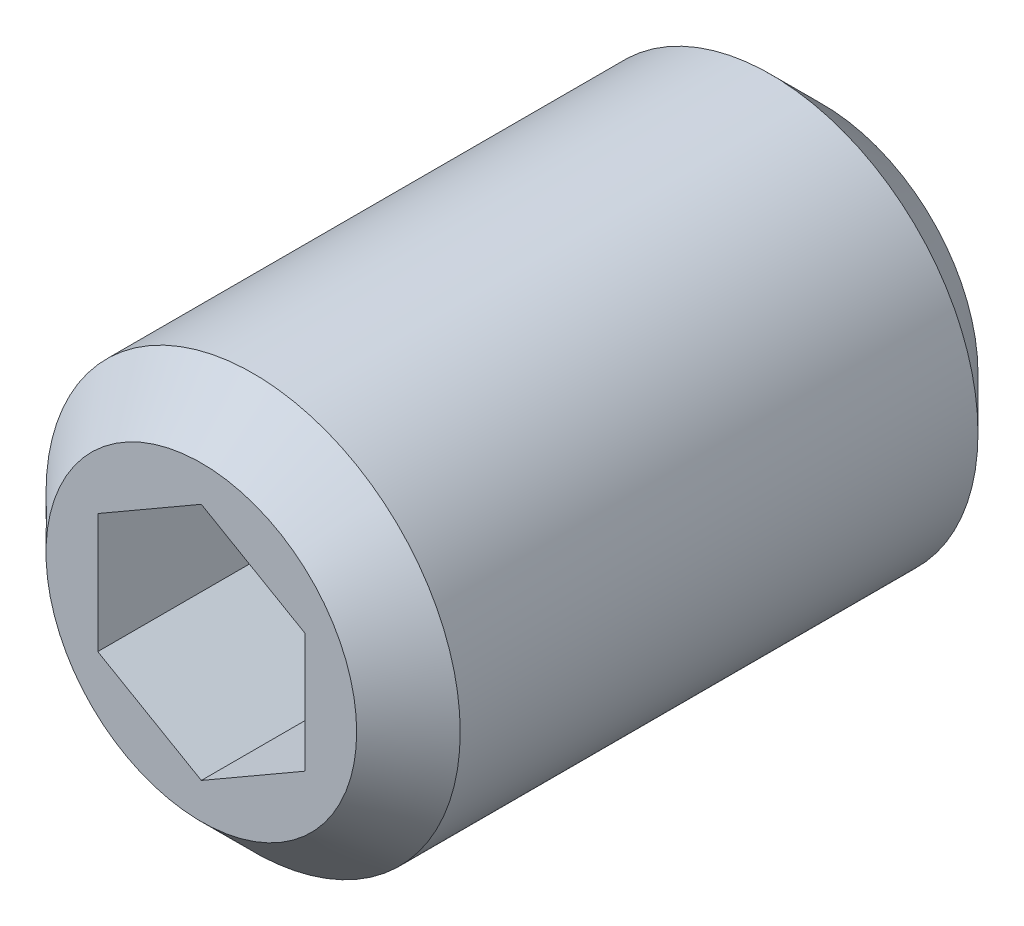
ISO-10303-21;
HEADER;
FILE_DESCRIPTION(('STEP AP214'),'2;1');
FILE_NAME('part.step','',(''),(''),'','','');
FILE_SCHEMA(('AUTOMOTIVE_DESIGN { 1 0 10303 214 1 1 1 1 }'));
ENDSEC;
DATA;
#1=APPLICATION_CONTEXT('core data for automotive mechanical design processes');
#2=APPLICATION_PROTOCOL_DEFINITION('international standard','automotive_design',2000,#1);
#3=PRODUCT_CONTEXT('',#1,'mechanical');
#4=PRODUCT('Part','Part','',(#3));
#5=PRODUCT_RELATED_PRODUCT_CATEGORY('part','',(#4));
#6=PRODUCT_DEFINITION_FORMATION('','',#4);
#7=PRODUCT_DEFINITION_CONTEXT('part definition',#1,'design');
#8=PRODUCT_DEFINITION('design','',#6,#7);
#9=PRODUCT_DEFINITION_SHAPE('','',#8);
#10=(LENGTH_UNIT() NAMED_UNIT(*) SI_UNIT(.MILLI.,.METRE.));
#11=(NAMED_UNIT(*) PLANE_ANGLE_UNIT() SI_UNIT($,.RADIAN.));
#12=(NAMED_UNIT(*) SI_UNIT($,.STERADIAN.) SOLID_ANGLE_UNIT());
#13=UNCERTAINTY_MEASURE_WITH_UNIT(LENGTH_MEASURE(1.E-05),#10,'distance_accuracy_value','');
#14=(GEOMETRIC_REPRESENTATION_CONTEXT(3) GLOBAL_UNCERTAINTY_ASSIGNED_CONTEXT((#13)) GLOBAL_UNIT_ASSIGNED_CONTEXT((#10,
#11,#12)) REPRESENTATION_CONTEXT('',''));
#15=CARTESIAN_POINT('',(0.,0.,0.));
#16=DIRECTION('',(0.,0.,1.));
#17=DIRECTION('',(1.,0.,0.));
#18=AXIS2_PLACEMENT_3D('',#15,#16,#17);
#19=CARTESIAN_POINT('',(0.,0.,0.));
#20=DIRECTION('',(0.,0.,1.));
#21=DIRECTION('',(1.,0.,0.));
#22=AXIS2_PLACEMENT_3D('',#19,#20,#21);
#23=CYLINDRICAL_SURFACE('',#22,2.);
#24=CARTESIAN_POINT('',(0.,0.,0.5));
#25=DIRECTION('',(0.,0.,1.));
#26=DIRECTION('',(1.,0.,0.));
#27=AXIS2_PLACEMENT_3D('',#24,#25,#26);
#28=CIRCLE('',#27,2.);
#29=CARTESIAN_POINT('',(2.,0.,0.5));
#30=VERTEX_POINT('',#29);
#31=EDGE_CURVE('E21',#30,#30,#28,.T.);
#32=ORIENTED_EDGE('',*,*,#31,.T.);
#33=EDGE_LOOP('',(#32));
#34=FACE_BOUND('',#33,.T.);
#35=CARTESIAN_POINT('',(0.,0.,5.5));
#36=DIRECTION('',(0.,0.,1.));
#37=DIRECTION('',(1.,0.,0.));
#38=AXIS2_PLACEMENT_3D('',#35,#36,#37);
#39=CIRCLE('',#38,2.);
#40=CARTESIAN_POINT('',(2.,0.,5.5));
#41=VERTEX_POINT('',#40);
#42=EDGE_CURVE('E124',#41,#41,#39,.F.);
#43=ORIENTED_EDGE('',*,*,#42,.T.);
#44=EDGE_LOOP('',(#43));
#45=FACE_BOUND('',#44,.T.);
#46=ADVANCED_FACE('F14',(#34,#45),#23,.T.);
#47=CARTESIAN_POINT('',(0.,0.,0.));
#48=DIRECTION('',(0.,0.,1.));
#49=DIRECTION('',(1.,0.,0.));
#50=AXIS2_PLACEMENT_3D('',#47,#48,#49);
#51=PLANE('',#50);
#52=CARTESIAN_POINT('',(0.,0.,0.));
#53=DIRECTION('',(0.,0.,1.));
#54=DIRECTION('',(1.,0.,0.));
#55=AXIS2_PLACEMENT_3D('',#52,#53,#54);
#56=CIRCLE('',#55,1.5);
#57=CARTESIAN_POINT('',(1.5,0.,0.));
#58=VERTEX_POINT('',#57);
#59=EDGE_CURVE('E9',#58,#58,#56,.F.);
#60=ORIENTED_EDGE('',*,*,#59,.T.);
#61=EDGE_LOOP('',(#60));
#62=FACE_BOUND('',#61,.T.);
#63=ADVANCED_FACE('F146',(#62),#51,.F.);
#64=CARTESIAN_POINT('',(0.,0.,6.));
#65=DIRECTION('',(0.,0.,1.));
#66=DIRECTION('',(1.,0.,0.));
#67=AXIS2_PLACEMENT_3D('',#64,#65,#66);
#68=PLANE('',#67);
#69=CARTESIAN_POINT('',(0.,0.,6.));
#70=DIRECTION('',(0.,0.,1.));
#71=DIRECTION('',(1.,0.,0.));
#72=AXIS2_PLACEMENT_3D('',#69,#70,#71);
#73=CIRCLE('',#72,1.5);
#74=CARTESIAN_POINT('',(1.5,0.,6.));
#75=VERTEX_POINT('',#74);
#76=EDGE_CURVE('E115',#75,#75,#73,.T.);
#77=ORIENTED_EDGE('',*,*,#76,.T.);
#78=EDGE_LOOP('',(#77));
#79=FACE_BOUND('',#78,.T.);
#80=DIRECTION('',(-0.866025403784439,0.5,0.));
#81=VECTOR('',#80,1.);
#82=CARTESIAN_POINT('',(1.,0.577350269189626,6.));
#83=LINE('',#82,#81);
#84=CARTESIAN_POINT('',(1.,0.577350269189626,6.));
#85=VERTEX_POINT('',#84);
#86=CARTESIAN_POINT('',(0.,1.15470053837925,6.));
#87=VERTEX_POINT('',#86);
#88=EDGE_CURVE('E28',#85,#87,#83,.T.);
#89=ORIENTED_EDGE('',*,*,#88,.F.);
#90=DIRECTION('',(0.,1.,0.));
#91=VECTOR('',#90,1.);
#92=CARTESIAN_POINT('',(1.,-0.577350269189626,6.));
#93=LINE('',#92,#91);
#94=CARTESIAN_POINT('',(1.,-0.577350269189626,6.));
#95=VERTEX_POINT('',#94);
#96=EDGE_CURVE('E97',#95,#85,#93,.T.);
#97=ORIENTED_EDGE('',*,*,#96,.F.);
#98=DIRECTION('',(0.866025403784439,0.5,0.));
#99=VECTOR('',#98,1.);
#100=CARTESIAN_POINT('',(0.,-1.15470053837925,6.));
#101=LINE('',#100,#99);
#102=CARTESIAN_POINT('',(0.,-1.15470053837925,6.));
#103=VERTEX_POINT('',#102);
#104=EDGE_CURVE('E91',#103,#95,#101,.T.);
#105=ORIENTED_EDGE('',*,*,#104,.F.);
#106=DIRECTION('',(0.866025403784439,-0.5,0.));
#107=VECTOR('',#106,1.);
#108=CARTESIAN_POINT('',(-1.,-0.577350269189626,6.));
#109=LINE('',#108,#107);
#110=CARTESIAN_POINT('',(-1.,-0.577350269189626,6.));
#111=VERTEX_POINT('',#110);
#112=EDGE_CURVE('E89',#111,#103,#109,.T.);
#113=ORIENTED_EDGE('',*,*,#112,.F.);
#114=DIRECTION('',(0.,-1.,0.));
#115=VECTOR('',#114,1.);
#116=CARTESIAN_POINT('',(-1.,0.577350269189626,6.));
#117=LINE('',#116,#115);
#118=CARTESIAN_POINT('',(-1.,0.577350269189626,6.));
#119=VERTEX_POINT('',#118);
#120=EDGE_CURVE('E71',#119,#111,#117,.T.);
#121=ORIENTED_EDGE('',*,*,#120,.F.);
#122=DIRECTION('',(-0.866025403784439,-0.5,0.));
#123=VECTOR('',#122,1.);
#124=CARTESIAN_POINT('',(0.,1.15470053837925,6.));
#125=LINE('',#124,#123);
#126=EDGE_CURVE('E82',#87,#119,#125,.T.);
#127=ORIENTED_EDGE('',*,*,#126,.F.);
#128=EDGE_LOOP('',(#89,#97,#105,#113,#121,#127));
#129=FACE_BOUND('',#128,.T.);
#130=ADVANCED_FACE('F86',(#79,#129),#68,.T.);
#131=CARTESIAN_POINT('',(1.,0.577350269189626,4.));
#132=DIRECTION('',(0.5,0.866025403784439,0.));
#133=DIRECTION('',(-0.866025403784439,0.5,0.));
#134=AXIS2_PLACEMENT_3D('',#131,#132,#133);
#135=PLANE('',#134);
#136=ORIENTED_EDGE('',*,*,#88,.T.);
#137=DIRECTION('',(0.,0.,1.));
#138=VECTOR('',#137,1.);
#139=CARTESIAN_POINT('',(0.,1.15470053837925,4.));
#140=LINE('',#139,#138);
#141=CARTESIAN_POINT('',(0.,1.15470053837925,4.));
#142=VERTEX_POINT('',#141);
#143=EDGE_CURVE('E79',#142,#87,#140,.T.);
#144=ORIENTED_EDGE('',*,*,#143,.F.);
#145=DIRECTION('',(-0.866025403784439,0.5,0.));
#146=VECTOR('',#145,1.);
#147=CARTESIAN_POINT('',(1.,0.577350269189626,4.));
#148=LINE('',#147,#146);
#149=CARTESIAN_POINT('',(1.,0.577350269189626,4.));
#150=VERTEX_POINT('',#149);
#151=EDGE_CURVE('E99',#150,#142,#148,.T.);
#152=ORIENTED_EDGE('',*,*,#151,.F.);
#153=DIRECTION('',(0.,0.,1.));
#154=VECTOR('',#153,1.);
#155=CARTESIAN_POINT('',(1.,0.577350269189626,4.));
#156=LINE('',#155,#154);
#157=EDGE_CURVE('E35',#150,#85,#156,.T.);
#158=ORIENTED_EDGE('',*,*,#157,.T.);
#159=EDGE_LOOP('',(#136,#144,#152,#158));
#160=FACE_BOUND('',#159,.T.);
#161=ADVANCED_FACE('F156',(#160),#135,.F.);
#162=CARTESIAN_POINT('',(1.,-0.577350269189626,4.));
#163=DIRECTION('',(1.,0.,0.));
#164=DIRECTION('',(0.,1.,0.));
#165=AXIS2_PLACEMENT_3D('',#162,#163,#164);
#166=PLANE('',#165);
#167=ORIENTED_EDGE('',*,*,#96,.T.);
#168=ORIENTED_EDGE('',*,*,#157,.F.);
#169=DIRECTION('',(0.,1.,0.));
#170=VECTOR('',#169,1.);
#171=CARTESIAN_POINT('',(1.,-0.577350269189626,4.));
#172=LINE('',#171,#170);
#173=CARTESIAN_POINT('',(1.,-0.577350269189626,4.));
#174=VERTEX_POINT('',#173);
#175=EDGE_CURVE('E111',#174,#150,#172,.T.);
#176=ORIENTED_EDGE('',*,*,#175,.F.);
#177=DIRECTION('',(0.,0.,1.));
#178=VECTOR('',#177,1.);
#179=CARTESIAN_POINT('',(1.,-0.577350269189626,4.));
#180=LINE('',#179,#178);
#181=EDGE_CURVE('E116',#174,#95,#180,.T.);
#182=ORIENTED_EDGE('',*,*,#181,.T.);
#183=EDGE_LOOP('',(#167,#168,#176,#182));
#184=FACE_BOUND('',#183,.T.);
#185=ADVANCED_FACE('F162',(#184),#166,.F.);
#186=CARTESIAN_POINT('',(0.,-1.15470053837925,4.));
#187=DIRECTION('',(0.5,-0.866025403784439,0.));
#188=DIRECTION('',(0.866025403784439,0.5,0.));
#189=AXIS2_PLACEMENT_3D('',#186,#187,#188);
#190=PLANE('',#189);
#191=ORIENTED_EDGE('',*,*,#104,.T.);
#192=ORIENTED_EDGE('',*,*,#181,.F.);
#193=DIRECTION('',(0.866025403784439,0.5,0.));
#194=VECTOR('',#193,1.);
#195=CARTESIAN_POINT('',(0.,-1.15470053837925,4.));
#196=LINE('',#195,#194);
#197=CARTESIAN_POINT('',(0.,-1.15470053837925,4.));
#198=VERTEX_POINT('',#197);
#199=EDGE_CURVE('E108',#198,#174,#196,.T.);
#200=ORIENTED_EDGE('',*,*,#199,.F.);
#201=DIRECTION('',(0.,0.,1.));
#202=VECTOR('',#201,1.);
#203=CARTESIAN_POINT('',(0.,-1.15470053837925,4.));
#204=LINE('',#203,#202);
#205=EDGE_CURVE('E118',#198,#103,#204,.T.);
#206=ORIENTED_EDGE('',*,*,#205,.T.);
#207=EDGE_LOOP('',(#191,#192,#200,#206));
#208=FACE_BOUND('',#207,.T.);
#209=ADVANCED_FACE('F170',(#208),#190,.F.);
#210=CARTESIAN_POINT('',(-1.,-0.577350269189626,4.));
#211=DIRECTION('',(-0.5,-0.866025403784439,0.));
#212=DIRECTION('',(0.866025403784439,-0.5,0.));
#213=AXIS2_PLACEMENT_3D('',#210,#211,#212);
#214=PLANE('',#213);
#215=ORIENTED_EDGE('',*,*,#112,.T.);
#216=ORIENTED_EDGE('',*,*,#205,.F.);
#217=DIRECTION('',(0.866025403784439,-0.5,0.));
#218=VECTOR('',#217,1.);
#219=CARTESIAN_POINT('',(-1.,-0.577350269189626,4.));
#220=LINE('',#219,#218);
#221=CARTESIAN_POINT('',(-1.,-0.577350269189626,4.));
#222=VERTEX_POINT('',#221);
#223=EDGE_CURVE('E105',#222,#198,#220,.T.);
#224=ORIENTED_EDGE('',*,*,#223,.F.);
#225=DIRECTION('',(0.,0.,1.));
#226=VECTOR('',#225,1.);
#227=CARTESIAN_POINT('',(-1.,-0.577350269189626,4.));
#228=LINE('',#227,#226);
#229=EDGE_CURVE('E78',#222,#111,#228,.T.);
#230=ORIENTED_EDGE('',*,*,#229,.T.);
#231=EDGE_LOOP('',(#215,#216,#224,#230));
#232=FACE_BOUND('',#231,.T.);
#233=ADVANCED_FACE('F167',(#232),#214,.F.);
#234=CARTESIAN_POINT('',(-1.,0.577350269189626,4.));
#235=DIRECTION('',(-1.,0.,0.));
#236=DIRECTION('',(0.,0.,1.));
#237=AXIS2_PLACEMENT_3D('',#234,#235,#236);
#238=PLANE('',#237);
#239=ORIENTED_EDGE('',*,*,#120,.T.);
#240=ORIENTED_EDGE('',*,*,#229,.F.);
#241=DIRECTION('',(0.,-1.,0.));
#242=VECTOR('',#241,1.);
#243=CARTESIAN_POINT('',(-1.,0.577350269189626,4.));
#244=LINE('',#243,#242);
#245=CARTESIAN_POINT('',(-1.,0.577350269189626,4.));
#246=VERTEX_POINT('',#245);
#247=EDGE_CURVE('E74',#246,#222,#244,.T.);
#248=ORIENTED_EDGE('',*,*,#247,.F.);
#249=DIRECTION('',(0.,0.,1.));
#250=VECTOR('',#249,1.);
#251=CARTESIAN_POINT('',(-1.,0.577350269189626,4.));
#252=LINE('',#251,#250);
#253=EDGE_CURVE('E67',#246,#119,#252,.T.);
#254=ORIENTED_EDGE('',*,*,#253,.T.);
#255=EDGE_LOOP('',(#239,#240,#248,#254));
#256=FACE_BOUND('',#255,.T.);
#257=ADVANCED_FACE('F69',(#256),#238,.F.);
#258=CARTESIAN_POINT('',(0.,1.15470053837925,4.));
#259=DIRECTION('',(-0.5,0.866025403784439,0.));
#260=DIRECTION('',(-0.866025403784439,-0.5,0.));
#261=AXIS2_PLACEMENT_3D('',#258,#259,#260);
#262=PLANE('',#261);
#263=ORIENTED_EDGE('',*,*,#126,.T.);
#264=ORIENTED_EDGE('',*,*,#253,.F.);
#265=DIRECTION('',(-0.866025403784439,-0.5,0.));
#266=VECTOR('',#265,1.);
#267=CARTESIAN_POINT('',(0.,1.15470053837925,4.));
#268=LINE('',#267,#266);
#269=EDGE_CURVE('E102',#142,#246,#268,.T.);
#270=ORIENTED_EDGE('',*,*,#269,.F.);
#271=ORIENTED_EDGE('',*,*,#143,.T.);
#272=EDGE_LOOP('',(#263,#264,#270,#271));
#273=FACE_BOUND('',#272,.T.);
#274=ADVANCED_FACE('F83',(#273),#262,.F.);
#275=CARTESIAN_POINT('',(0.,1.15470053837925,4.));
#276=DIRECTION('',(0.,0.,1.));
#277=DIRECTION('',(1.,0.,0.));
#278=AXIS2_PLACEMENT_3D('',#275,#276,#277);
#279=PLANE('',#278);
#280=ORIENTED_EDGE('',*,*,#151,.T.);
#281=ORIENTED_EDGE('',*,*,#269,.T.);
#282=ORIENTED_EDGE('',*,*,#247,.T.);
#283=ORIENTED_EDGE('',*,*,#223,.T.);
#284=ORIENTED_EDGE('',*,*,#199,.T.);
#285=ORIENTED_EDGE('',*,*,#175,.T.);
#286=EDGE_LOOP('',(#280,#281,#282,#283,#284,#285));
#287=FACE_BOUND('',#286,.T.);
#288=ADVANCED_FACE('F141',(#287),#279,.T.);
#289=CARTESIAN_POINT('',(0.,0.,6.));
#290=DIRECTION('',(0.,0.,-1.));
#291=DIRECTION('',(-1.,0.,0.));
#292=AXIS2_PLACEMENT_3D('',#289,#290,#291);
#293=CONICAL_SURFACE('',#292,1.5,0.785398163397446);
#294=ORIENTED_EDGE('',*,*,#42,.F.);
#295=EDGE_LOOP('',(#294));
#296=FACE_BOUND('',#295,.T.);
#297=ORIENTED_EDGE('',*,*,#76,.F.);
#298=EDGE_LOOP('',(#297));
#299=FACE_BOUND('',#298,.T.);
#300=ADVANCED_FACE('F133',(#296,#299),#293,.T.);
#301=CARTESIAN_POINT('',(0.,0.,0.5));
#302=DIRECTION('',(0.,0.,1.));
#303=DIRECTION('',(1.,0.,0.));
#304=AXIS2_PLACEMENT_3D('',#301,#302,#303);
#305=CONICAL_SURFACE('',#304,2.,0.78539816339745);
#306=ORIENTED_EDGE('',*,*,#59,.F.);
#307=EDGE_LOOP('',(#306));
#308=FACE_BOUND('',#307,.T.);
#309=ORIENTED_EDGE('',*,*,#31,.F.);
#310=EDGE_LOOP('',(#309));
#311=FACE_BOUND('',#310,.T.);
#312=ADVANCED_FACE('F131',(#308,#311),#305,.T.);
#313=CLOSED_SHELL('',(#46,#63,#130,#161,#185,#209,#233,#257,#274,#288,#300,#312));
#314=MANIFOLD_SOLID_BREP('B1',#313);
#315=ADVANCED_BREP_SHAPE_REPRESENTATION('',(#18,#314),#14);
#316=SHAPE_DEFINITION_REPRESENTATION(#9,#315);
ENDSEC;
END-ISO-10303-21;
